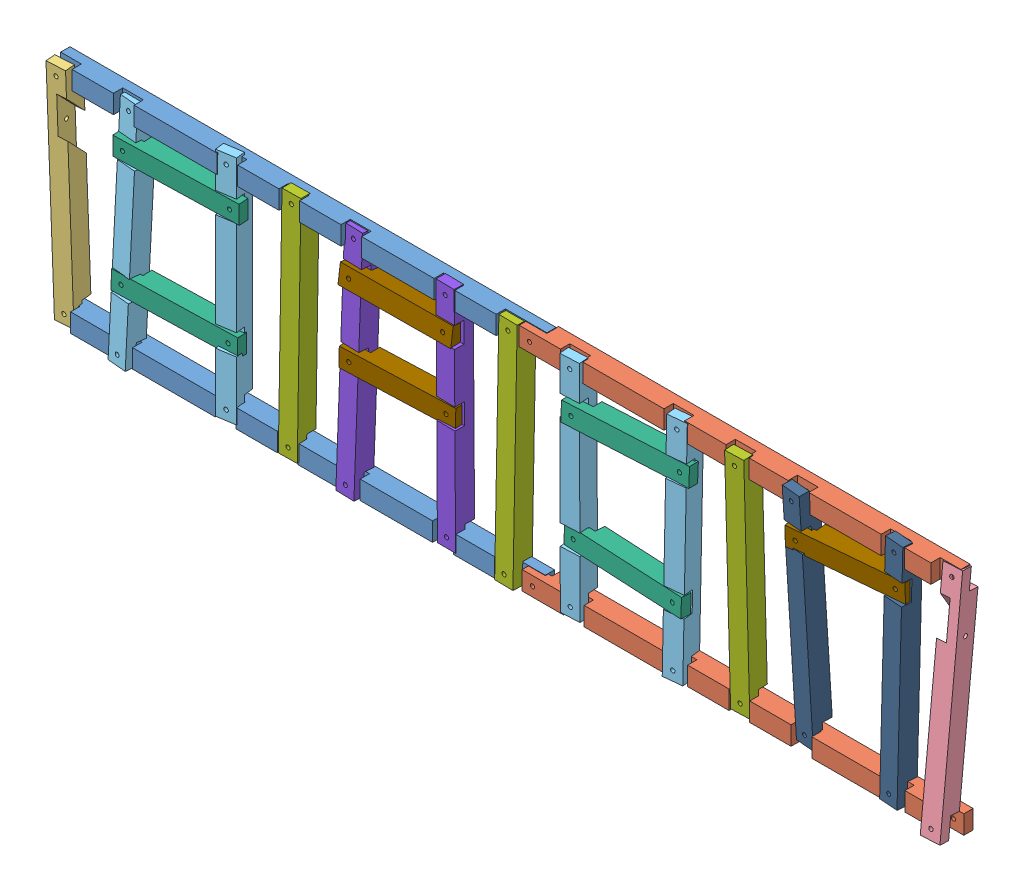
SolidWorks assembly Assemblage_AR_notes.SLDASM, configuration Défaut (file format 3400). Lengths in mm.
Overall size (436.13 112.67 20.37).
24 component instances, 10 part files, 0 mates.
Components (placement in the parent):
- Base_D-AR-1: Base_D-AR.SLDPRT [Défaut] at (-112.7861 63.9546 0) size (235 9 9)
- Base_D-AR-2: Base_D-AR.SLDPRT [Défaut] at (-112.054 165.8116 0) size (235 9 9)
- Base_G-AR-1: Base_G-AR.SLDPRT [Défaut] at (112.7973 165.5355 -1.2408) size (209 9 9)
- Base_G-AR-2: Base_G-AR.SLDPRT [Défaut] at (114.0428 63.7916 -1.4349) size (209 9 9)
- montant_1-1: montant_1.SLDPRT [Default] at (-2.9572 132.1441 3.9027) x (-0.004401 0.999455 0.032729) z (-0.052403 0.032454 -0.998099) size (110 9 9)
- montant13-30-1: montant13-30.SLDPRT [Default] at (423.0728 131.2281 1.7351) x (0.000698 0.995067 -0.099202) z (-0.057602 -0.098997 -0.993419) size (110 9 9)
- montant_T3-1: montant_T3.SLDPRT [Default] at (-131.5515 107.1485 23.7671) x (0.016162 -0.999732 0.016584) z (-0.138703 -0.018667 -0.990158) size (110 9 9)
- montant_T3-2: montant_T3.SLDPRT [Default] at (-182.5214 107.7543 1.2074) x (-0.015948 -0.999145 0.038132) z (0.077862 -0.039262 -0.996191) size (110 9 9)
- montant_T3-3: montant_T3.SLDPRT [Default] at (33.4776 108.9259 15.0583) x (-0.012898 -0.9998 -0.015279) z (-0.059304 0.016018 -0.998111) size (110 9 9)
- montant_T3-4: montant_T3.SLDPRT [Default] at (84.6411 108.3026 20.8511) x (-0.011476 -0.9999 0.008311) z (-0.112134 -0.006972 -0.993669) size (110 9 9)
- traverse_T3-1: traverse_T3.SLDPRT [Défaut] at (-82.0217 101.9083 9.9749) x (0.999336 -0.008817 -0.035354) z (-0.035476 -0.014086 -0.999271) size (59 9 9)
- traverse_T3-2: traverse_T3.SLDPRT [Défaut] at (-81.2601 158.2739 10.1036) x (0.999367 -0.008338 -0.034588) z (-0.034419 0.019576 -0.999216) size (59 9 9)
- traverse_T3-3: traverse_T3.SLDPRT [Défaut] at (134.6624 102.7441 7.6629) x (0.999094 -0.009667 0.041454) z (0.041205 -0.024656 -0.998846) size (59 9 9)
- traverse_T3-4: traverse_T3.SLDPRT [Défaut] at (135.7736 155.9723 10.2375) x (0.998757 0.002751 -0.04977) z (-0.049575 -0.049026 -0.997566) size (59 9 9)
- montant-1: montant.SLDPRT [Default] at (-101.9884 107.8047 10.8283) x (0.000319 -0.999869 0.016167) z (-0.015513 -0.01617 -0.999749) size (110 9 9)
- montant_22-23-1: montant_22-23.SLDPRT [Default] at (-26.4133 106.9803 6.4657) x (0.007214 -0.999974 0.000745) z (0.024188 -0.00057 -0.999707) size (110 9 9)
- montant_22-23-2: montant_22-23.SLDPRT [Default] at (-73.1155 106.9217 6.1397) x (0.001018 -0.999208 0.039788) z (0.031865 -0.039735 -0.998702) size (110 9 9)
- traverse_T1-1: traverse_T1.SLDPRT [Défaut] at (244.6506 158.5372 11.1811) x (0.996925 0.009854 -0.077737) z (-0.077929 0.020816 -0.996742) size (54 9 9)
- traverse_T1-2: traverse_T1.SLDPRT [Défaut] at (28.2486 124.7282 10.1376) x (0.999015 -0.006579 -0.043893) z (-0.043953 -0.009279 -0.99899) size (54 9 9)
- traverse_T1-3: traverse_T1.SLDPRT [Défaut] at (27.2872 158.7279 8.637) x (0.999955 -0.002152 -0.00928) z (-0.00948 -0.128051 -0.991722) size (54 9 9)
- montant-2: montant.SLDPRT [Default] at (114.3488 107.7153 12.033) x (-0.001866 -0.999598 -0.02828) z (-0.032155 0.028325 -0.999081) size (110 9 9)
- montant-3: montant.SLDPRT [Default] at (2.5517 106.9516 7.2202) x (0.000682 -0.999815 0.019227) z (0.019177 -0.01921 -0.999632) size (110 9 9)
- montant_T1-1: montant_T1.SLDPRT [Default] at (188.847 109.0011 2.144) x (-0.012313 -0.999835 0.01333) z (0.066517 -0.014121 -0.997685) size (110 9 9)
- montant_T1-2: montant_T1.SLDPRT [Default] at (144.0019 108.5704 -0.7857) x (0.002177 -0.998164 -0.060535) z (0.085815 0.060499 -0.994473) size (110 9 9)
